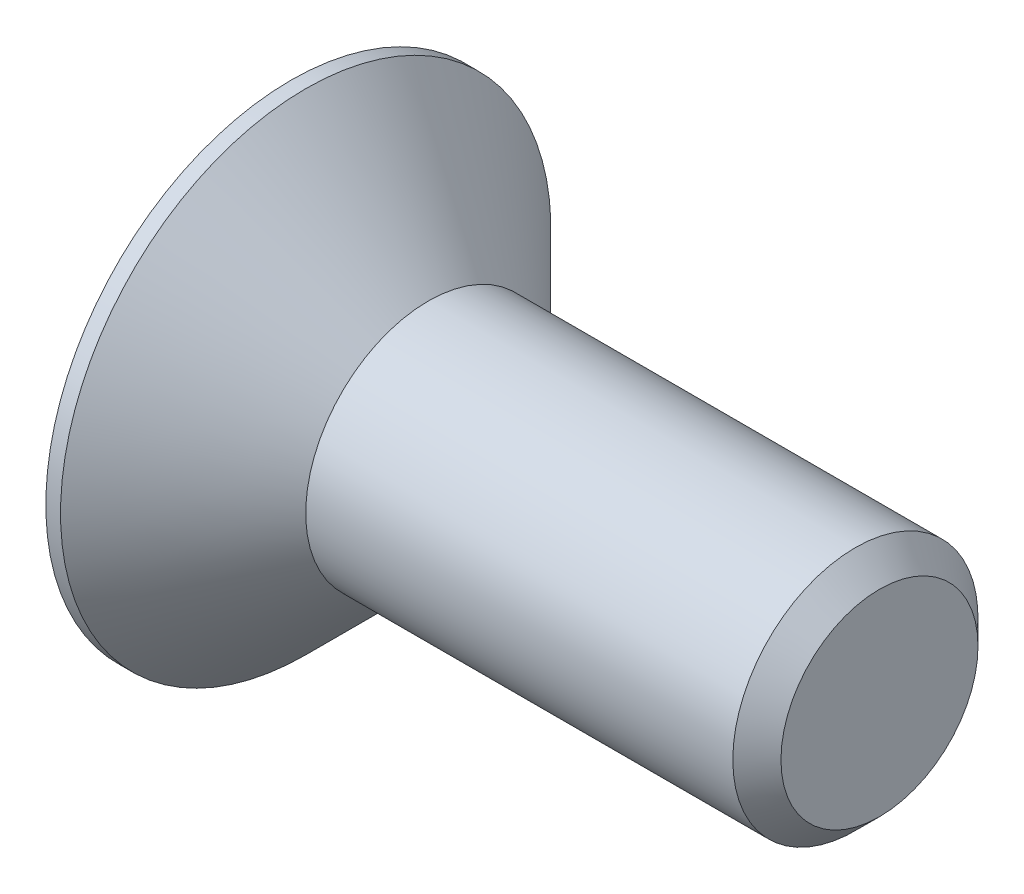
ISO-10303-21;
HEADER;
FILE_DESCRIPTION(('STEP AP214'),'2;1');
FILE_NAME('part.step','',(''),(''),'','','');
FILE_SCHEMA(('AUTOMOTIVE_DESIGN { 1 0 10303 214 1 1 1 1 }'));
ENDSEC;
DATA;
#1=APPLICATION_CONTEXT('core data for automotive mechanical design processes');
#2=APPLICATION_PROTOCOL_DEFINITION('international standard','automotive_design',2000,#1);
#3=PRODUCT_CONTEXT('',#1,'mechanical');
#4=PRODUCT('Part','Part','',(#3));
#5=PRODUCT_RELATED_PRODUCT_CATEGORY('part','',(#4));
#6=PRODUCT_DEFINITION_FORMATION('','',#4);
#7=PRODUCT_DEFINITION_CONTEXT('part definition',#1,'design');
#8=PRODUCT_DEFINITION('design','',#6,#7);
#9=PRODUCT_DEFINITION_SHAPE('','',#8);
#10=(LENGTH_UNIT() NAMED_UNIT(*) SI_UNIT(.MILLI.,.METRE.));
#11=(NAMED_UNIT(*) PLANE_ANGLE_UNIT() SI_UNIT($,.RADIAN.));
#12=(NAMED_UNIT(*) SI_UNIT($,.STERADIAN.) SOLID_ANGLE_UNIT());
#13=UNCERTAINTY_MEASURE_WITH_UNIT(LENGTH_MEASURE(1.E-05),#10,'distance_accuracy_value','');
#14=(GEOMETRIC_REPRESENTATION_CONTEXT(3) GLOBAL_UNCERTAINTY_ASSIGNED_CONTEXT((#13)) GLOBAL_UNIT_ASSIGNED_CONTEXT((#10,
#11,#12)) REPRESENTATION_CONTEXT('',''));
#15=CARTESIAN_POINT('',(0.,0.,0.));
#16=DIRECTION('',(0.,0.,1.));
#17=DIRECTION('',(1.,0.,0.));
#18=AXIS2_PLACEMENT_3D('',#15,#16,#17);
#19=CARTESIAN_POINT('',(12.,1.25,0.));
#20=DIRECTION('',(1.,0.,0.));
#21=DIRECTION('',(0.,1.,0.));
#22=AXIS2_PLACEMENT_3D('',#19,#20,#21);
#23=PLANE('',#22);
#24=CARTESIAN_POINT('',(11.9999999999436,0.,0.));
#25=DIRECTION('',(-1.,0.,0.));
#26=DIRECTION('',(0.,0.,1.));
#27=AXIS2_PLACEMENT_3D('',#24,#25,#26);
#28=CIRCLE('',#27,2.00924000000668);
#29=CARTESIAN_POINT('',(11.9999999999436,0.,2.00924000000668));
#30=VERTEX_POINT('',#29);
#31=EDGE_CURVE('E20',#30,#30,#28,.T.);
#32=ORIENTED_EDGE('',*,*,#31,.F.);
#33=EDGE_LOOP('',(#32));
#34=FACE_BOUND('',#33,.T.);
#35=ADVANCED_FACE('F16',(#34),#23,.T.);
#36=CARTESIAN_POINT('',(11.5092399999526,0.,0.));
#37=DIRECTION('',(-1.,0.,0.));
#38=DIRECTION('',(0.,0.,1.));
#39=AXIS2_PLACEMENT_3D('',#36,#37,#38);
#40=CONICAL_SURFACE('',#39,2.49999999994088,0.785398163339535);
#41=CARTESIAN_POINT('',(11.50924,0.,0.));
#42=DIRECTION('',(1.,0.,0.));
#43=DIRECTION('',(0.,1.,0.));
#44=AXIS2_PLACEMENT_3D('',#41,#42,#43);
#45=CIRCLE('',#44,2.49999999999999);
#46=CARTESIAN_POINT('',(11.50924,2.49999999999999,0.));
#47=VERTEX_POINT('',#46);
#48=EDGE_CURVE('E94',#47,#47,#45,.F.);
#49=ORIENTED_EDGE('',*,*,#48,.F.);
#50=EDGE_LOOP('',(#49));
#51=FACE_BOUND('',#50,.T.);
#52=ORIENTED_EDGE('',*,*,#31,.T.);
#53=EDGE_LOOP('',(#52));
#54=FACE_BOUND('',#53,.T.);
#55=ADVANCED_FACE('F212',(#51,#54),#40,.T.);
#56=CARTESIAN_POINT('',(0.,-1.5,0.866025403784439));
#57=DIRECTION('',(0.,-0.5,0.866025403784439));
#58=DIRECTION('',(0.,-0.866025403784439,-0.5));
#59=AXIS2_PLACEMENT_3D('',#56,#57,#58);
#60=PLANE('',#59);
#61=DIRECTION('',(1.,0.,0.));
#62=VECTOR('',#61,1.);
#63=CARTESIAN_POINT('',(0.,-1.5,0.866025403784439));
#64=LINE('',#63,#62);
#65=CARTESIAN_POINT('',(2.3000000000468,-1.50000000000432,0.866025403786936));
#66=VERTEX_POINT('',#65);
#67=CARTESIAN_POINT('',(0.,-1.5,0.866025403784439));
#68=VERTEX_POINT('',#67);
#69=EDGE_CURVE('E90',#66,#68,#64,.F.);
#70=ORIENTED_EDGE('',*,*,#69,.T.);
#71=DIRECTION('',(0.,-0.866025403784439,-0.5));
#72=VECTOR('',#71,1.);
#73=CARTESIAN_POINT('',(0.,-1.5,0.866025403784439));
#74=LINE('',#73,#72);
#75=CARTESIAN_POINT('',(0.,0.,1.73205080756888));
#76=VERTEX_POINT('',#75);
#77=EDGE_CURVE('E95',#76,#68,#74,.T.);
#78=ORIENTED_EDGE('',*,*,#77,.F.);
#79=DIRECTION('',(1.,0.,0.));
#80=VECTOR('',#79,1.);
#81=CARTESIAN_POINT('',(0.,0.,1.73205080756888));
#82=LINE('',#81,#80);
#83=CARTESIAN_POINT('',(2.30000000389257,-1.15286589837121E-08,1.7320508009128));
#84=VERTEX_POINT('',#83);
#85=EDGE_CURVE('E93',#76,#84,#82,.T.);
#86=ORIENTED_EDGE('',*,*,#85,.T.);
#87=CARTESIAN_POINT('',(2.3000000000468,-1.50000000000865,0.866025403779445));
#88=CARTESIAN_POINT('',(2.32197834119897,-1.43408408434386,0.904081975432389));
#89=CARTESIAN_POINT('',(2.34196649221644,-1.36759918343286,0.942467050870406));
#90=CARTESIAN_POINT('',(2.3768552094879,-1.23347824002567,1.01990181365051));
#91=CARTESIAN_POINT('',(2.39174343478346,-1.16583981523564,1.0589528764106));
#92=CARTESIAN_POINT('',(2.41491803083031,-1.0314011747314,1.13657106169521));
#93=CARTESIAN_POINT('',(2.42335865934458,-0.964621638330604,1.17512624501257));
#94=CARTESIAN_POINT('',(2.43343312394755,-0.830748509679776,1.25241793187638));
#95=CARTESIAN_POINT('',(2.43507530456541,-0.76365540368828,1.29115415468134));
#96=CARTESIAN_POINT('',(2.43165028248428,-0.638299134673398,1.36352863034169));
#97=CARTESIAN_POINT('',(2.42742403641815,-0.580017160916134,1.39717774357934));
#98=CARTESIAN_POINT('',(2.41403202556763,-0.463832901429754,1.4642567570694));
#99=CARTESIAN_POINT('',(2.40486169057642,-0.405931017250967,1.49768642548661));
#100=CARTESIAN_POINT('',(2.38193762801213,-0.289507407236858,1.56490362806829));
#101=CARTESIAN_POINT('',(2.3680867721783,-0.231000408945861,1.59868265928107));
#102=CARTESIAN_POINT('',(2.33665118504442,-0.114858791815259,1.66573705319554));
#103=CARTESIAN_POINT('',(2.31907383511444,-0.0572226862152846,1.69901327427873));
#104=CARTESIAN_POINT('',(2.30000000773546,-2.3057318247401E-08,1.73205079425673));
#105=B_SPLINE_CURVE_WITH_KNOTS('',3,(#87,#88,#89,#90,#91,#92,#93,#94,#95,#96,#97,#98,#99,#100,
#101,#102,#103,#104),.UNSPECIFIED.,.F.,.F.,(4,2,2,2,2,2,2,2,4),(0.,0.237762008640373,
0.476095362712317,0.708530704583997,0.940680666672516,1.14278083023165,1.34506813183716,
1.55184119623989,1.75820845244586),.UNSPECIFIED.);
#106=EDGE_CURVE('E74',#66,#84,#105,.T.);
#107=ORIENTED_EDGE('',*,*,#106,.F.);
#108=EDGE_LOOP('',(#70,#78,#86,#107));
#109=FACE_BOUND('',#108,.T.);
#110=ADVANCED_FACE('F88',(#109),#60,.F.);
#111=CARTESIAN_POINT('',(8.59999999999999,0.,0.));
#112=DIRECTION('',(1.,0.,0.));
#113=DIRECTION('',(0.,1.,0.));
#114=AXIS2_PLACEMENT_3D('',#111,#112,#113);
#115=CYLINDRICAL_SURFACE('',#114,2.49999999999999);
#116=ORIENTED_EDGE('',*,*,#48,.T.);
#117=EDGE_LOOP('',(#116));
#118=FACE_BOUND('',#117,.T.);
#119=CARTESIAN_POINT('',(2.79999999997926,0.,0.));
#120=DIRECTION('',(-1.,0.,0.));
#121=DIRECTION('',(0.,1.,0.));
#122=AXIS2_PLACEMENT_3D('',#119,#120,#121);
#123=CIRCLE('',#122,2.49999999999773);
#124=CARTESIAN_POINT('',(2.79999999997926,2.49999999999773,0.));
#125=VERTEX_POINT('',#124);
#126=EDGE_CURVE('E110',#125,#125,#123,.T.);
#127=ORIENTED_EDGE('',*,*,#126,.F.);
#128=EDGE_LOOP('',(#127));
#129=FACE_BOUND('',#128,.T.);
#130=ADVANCED_FACE('F204',(#118,#129),#115,.T.);
#131=CARTESIAN_POINT('',(0.,-1.5,-0.866025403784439));
#132=DIRECTION('',(0.,-1.,0.));
#133=DIRECTION('',(0.,0.,-1.));
#134=AXIS2_PLACEMENT_3D('',#131,#132,#133);
#135=PLANE('',#134);
#136=DIRECTION('',(1.,0.,0.));
#137=VECTOR('',#136,1.);
#138=CARTESIAN_POINT('',(0.,-1.5,-0.866025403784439));
#139=LINE('',#138,#137);
#140=CARTESIAN_POINT('',(2.29999999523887,-1.5,-0.8660254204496));
#141=VERTEX_POINT('',#140);
#142=CARTESIAN_POINT('',(0.,-1.5,-0.866025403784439));
#143=VERTEX_POINT('',#142);
#144=EDGE_CURVE('E108',#141,#143,#139,.F.);
#145=ORIENTED_EDGE('',*,*,#144,.T.);
#146=DIRECTION('',(0.,0.,-1.));
#147=VECTOR('',#146,1.);
#148=CARTESIAN_POINT('',(0.,-1.5,-0.866025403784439));
#149=LINE('',#148,#147);
#150=EDGE_CURVE('E83',#68,#143,#149,.T.);
#151=ORIENTED_EDGE('',*,*,#150,.F.);
#152=ORIENTED_EDGE('',*,*,#69,.F.);
#153=CARTESIAN_POINT('',(2.29999999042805,-1.5,-0.86602543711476));
#154=CARTESIAN_POINT('',(2.32052466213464,-1.5,-0.794933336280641));
#155=CARTESIAN_POINT('',(2.33931557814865,-1.5,-0.723278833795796));
#156=CARTESIAN_POINT('',(2.37252619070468,-1.5,-0.578805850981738));
#157=CARTESIAN_POINT('',(2.38693610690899,-1.5,-0.505985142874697));
#158=CARTESIAN_POINT('',(2.41010899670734,-1.5,-0.36116084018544));
#159=CARTESIAN_POINT('',(2.41899551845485,-1.5,-0.289177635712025));
#160=CARTESIAN_POINT('',(2.43092514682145,-1.5,-0.144795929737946));
#161=CARTESIAN_POINT('',(2.43397459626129,-1.5,-0.0723979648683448));
#162=CARTESIAN_POINT('',(2.43397459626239,-1.5,0.0723979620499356));
#163=CARTESIAN_POINT('',(2.43092514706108,-1.5,0.144795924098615));
#164=CARTESIAN_POINT('',(2.41899551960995,-1.5,0.289177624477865));
#165=CARTESIAN_POINT('',(2.41010899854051,-1.5,0.36116082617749));
#166=CARTESIAN_POINT('',(2.38693611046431,-1.5,0.505985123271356));
#167=CARTESIAN_POINT('',(2.37252619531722,-1.5,0.578805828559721));
#168=CARTESIAN_POINT('',(2.33931558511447,-1.5,0.72327880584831));
#169=CARTESIAN_POINT('',(2.32052467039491,-1.5,0.794933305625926));
#170=CARTESIAN_POINT('',(2.3000000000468,-1.5,0.866025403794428));
#171=B_SPLINE_CURVE_WITH_KNOTS('',3,(#153,#154,#155,#156,#157,#158,#159,#160,#161,#162,#163,
#164,#165,#166,#167,#168,#169,#170),.UNSPECIFIED.,.F.,.F.,(4,2,2,2,2,2,2,2,4),(0.,
0.22205505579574,0.444602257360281,0.661973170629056,0.879107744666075,1.09624231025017,
1.31361321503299,1.53616040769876,1.75821545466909),.UNSPECIFIED.);
#172=EDGE_CURVE('E69',#141,#66,#171,.T.);
#173=ORIENTED_EDGE('',*,*,#172,.F.);
#174=EDGE_LOOP('',(#145,#151,#152,#173));
#175=FACE_BOUND('',#174,.T.);
#176=ADVANCED_FACE('F96',(#175),#135,.F.);
#177=CARTESIAN_POINT('',(0.,0.,1.73205080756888));
#178=DIRECTION('',(0.,0.500000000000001,0.866025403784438));
#179=DIRECTION('',(0.,-0.866025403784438,0.500000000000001));
#180=AXIS2_PLACEMENT_3D('',#177,#178,#179);
#181=PLANE('',#180);
#182=ORIENTED_EDGE('',*,*,#85,.F.);
#183=DIRECTION('',(0.,-0.866025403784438,0.500000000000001));
#184=VECTOR('',#183,1.);
#185=CARTESIAN_POINT('',(0.,0.,1.73205080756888));
#186=LINE('',#185,#184);
#187=CARTESIAN_POINT('',(0.,1.5,0.866025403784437));
#188=VERTEX_POINT('',#187);
#189=EDGE_CURVE('E82',#188,#76,#186,.T.);
#190=ORIENTED_EDGE('',*,*,#189,.F.);
#191=DIRECTION('',(1.,0.,0.));
#192=VECTOR('',#191,1.);
#193=CARTESIAN_POINT('',(0.,1.5,0.866025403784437));
#194=LINE('',#193,#192);
#195=CARTESIAN_POINT('',(2.3000000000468,1.50000000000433,0.866025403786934));
#196=VERTEX_POINT('',#195);
#197=EDGE_CURVE('E113',#188,#196,#194,.T.);
#198=ORIENTED_EDGE('',*,*,#197,.T.);
#199=CARTESIAN_POINT('',(2.30000000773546,2.30573176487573E-08,1.73205079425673));
#200=CARTESIAN_POINT('',(2.32197834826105,0.0659159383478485,1.69399422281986));
#201=CARTESIAN_POINT('',(2.34196649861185,0.132400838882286,1.65560914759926));
#202=CARTESIAN_POINT('',(2.37685521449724,0.266521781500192,1.57817438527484));
#203=CARTESIAN_POINT('',(2.39174343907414,0.33416020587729,1.53912332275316));
#204=CARTESIAN_POINT('',(2.41491803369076,0.468598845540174,1.46150513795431));
#205=CARTESIAN_POINT('',(2.42335866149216,0.535378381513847,1.42294995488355));
#206=CARTESIAN_POINT('',(2.43343312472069,0.669251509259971,1.34565826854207));
#207=CARTESIAN_POINT('',(2.43507530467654,0.73634461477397,1.30692204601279));
#208=CARTESIAN_POINT('',(2.43165028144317,0.861700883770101,1.23454757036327));
#209=CARTESIAN_POINT('',(2.42742403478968,0.919982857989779,1.20089845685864));
#210=CARTESIAN_POINT('',(2.41403202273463,1.03616711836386,1.13381944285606));
#211=CARTESIAN_POINT('',(2.40486168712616,1.09406900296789,1.10038977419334));
#212=CARTESIAN_POINT('',(2.38193762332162,1.21049261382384,1.03317257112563));
#213=CARTESIAN_POINT('',(2.36808676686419,1.26899961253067,0.999393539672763));
#214=CARTESIAN_POINT('',(2.33665117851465,1.38514123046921,0.932339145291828));
#215=CARTESIAN_POINT('',(2.31907382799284,1.44277733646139,0.8990629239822));
#216=CARTESIAN_POINT('',(2.3000000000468,1.50000000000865,0.866025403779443));
#217=B_SPLINE_CURVE_WITH_KNOTS('',3,(#199,#200,#201,#202,#203,#204,#205,#206,#207,#208,#209,
#210,#211,#212,#213,#214,#215,#216),.UNSPECIFIED.,.F.,.F.,(4,2,2,2,2,2,2,2,4),(0.,
0.237762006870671,0.476095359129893,0.708530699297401,0.940680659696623,1.14278082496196,
1.34506812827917,1.55184119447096,1.75820845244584),.UNSPECIFIED.);
#218=EDGE_CURVE('E105',#84,#196,#217,.T.);
#219=ORIENTED_EDGE('',*,*,#218,.F.);
#220=EDGE_LOOP('',(#182,#190,#198,#219));
#221=FACE_BOUND('',#220,.T.);
#222=ADVANCED_FACE('F195',(#221),#181,.F.);
#223=CARTESIAN_POINT('',(0.300000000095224,0.,0.));
#224=DIRECTION('',(-1.,0.,0.));
#225=DIRECTION('',(0.,0.,1.));
#226=AXIS2_PLACEMENT_3D('',#223,#224,#225);
#227=CONICAL_SURFACE('',#226,4.99999999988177,0.785398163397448);
#228=ORIENTED_EDGE('',*,*,#126,.T.);
#229=EDGE_LOOP('',(#228));
#230=FACE_BOUND('',#229,.T.);
#231=CARTESIAN_POINT('',(0.29999999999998,0.,0.));
#232=DIRECTION('',(1.,0.,0.));
#233=DIRECTION('',(0.,1.,0.));
#234=AXIS2_PLACEMENT_3D('',#231,#232,#233);
#235=CIRCLE('',#234,5.00000000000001);
#236=CARTESIAN_POINT('',(0.29999999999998,5.00000000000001,0.));
#237=VERTEX_POINT('',#236);
#238=EDGE_CURVE('E127',#237,#237,#235,.F.);
#239=ORIENTED_EDGE('',*,*,#238,.F.);
#240=EDGE_LOOP('',(#239));
#241=FACE_BOUND('',#240,.T.);
#242=ADVANCED_FACE('F191',(#230,#241),#227,.T.);
#243=CARTESIAN_POINT('',(0.,0.,-1.73205080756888));
#244=DIRECTION('',(0.,-0.5,-0.866025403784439));
#245=DIRECTION('',(0.,0.866025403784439,-0.5));
#246=AXIS2_PLACEMENT_3D('',#243,#244,#245);
#247=PLANE('',#246);
#248=DIRECTION('',(1.,0.,0.));
#249=VECTOR('',#248,1.);
#250=CARTESIAN_POINT('',(0.,0.,-1.73205080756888));
#251=LINE('',#250,#249);
#252=CARTESIAN_POINT('',(2.3000000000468,0.,-1.73205080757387));
#253=VERTEX_POINT('',#252);
#254=CARTESIAN_POINT('',(0.,0.,-1.73205080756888));
#255=VERTEX_POINT('',#254);
#256=EDGE_CURVE('E123',#253,#255,#251,.F.);
#257=ORIENTED_EDGE('',*,*,#256,.T.);
#258=DIRECTION('',(0.,0.866025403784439,-0.5));
#259=VECTOR('',#258,1.);
#260=CARTESIAN_POINT('',(0.,0.,-1.73205080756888));
#261=LINE('',#260,#259);
#262=EDGE_CURVE('E34',#143,#255,#261,.T.);
#263=ORIENTED_EDGE('',*,*,#262,.F.);
#264=ORIENTED_EDGE('',*,*,#144,.F.);
#265=CARTESIAN_POINT('',(2.3000000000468,8.65064451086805E-12,-1.73205080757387));
#266=CARTESIAN_POINT('',(2.32197834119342,-0.0659159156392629,-1.69399423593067));
#267=CARTESIAN_POINT('',(2.34196649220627,-0.132400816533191,-1.65560916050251));
#268=CARTESIAN_POINT('',(2.37685520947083,-0.266521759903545,-1.57817439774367));
#269=CARTESIAN_POINT('',(2.39174343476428,-0.334160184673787,-1.53912333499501));
#270=CARTESIAN_POINT('',(2.41491803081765,-0.468598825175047,-1.46150514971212));
#271=CARTESIAN_POINT('',(2.42335865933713,-0.535378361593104,-1.4229499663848));
#272=CARTESIAN_POINT('',(2.43343312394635,-0.669251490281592,-1.34565827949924));
#273=CARTESIAN_POINT('',(2.43507530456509,-0.736344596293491,-1.3069220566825));
#274=CARTESIAN_POINT('',(2.4316502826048,-0.861700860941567,-1.23454758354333));
#275=CARTESIAN_POINT('',(2.42742403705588,-0.919982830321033,-1.2008984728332));
#276=CARTESIAN_POINT('',(2.41403202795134,-1.03616708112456,-1.13381946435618));
#277=CARTESIAN_POINT('',(2.40486169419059,-1.09406896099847,-1.1003897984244));
#278=CARTESIAN_POINT('',(2.38193763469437,-1.21049256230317,-1.03317260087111));
#279=CARTESIAN_POINT('',(2.36808678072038,-1.26899955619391,-0.999393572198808));
#280=CARTESIAN_POINT('',(2.33665119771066,-1.38514116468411,-0.932339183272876));
#281=CARTESIAN_POINT('',(2.31907385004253,-1.44277726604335,-0.899062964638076));
#282=CARTESIAN_POINT('',(2.300000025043,-1.49999992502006,-0.86602544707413));
#283=B_SPLINE_CURVE_WITH_KNOTS('',3,(#265,#266,#267,#268,#269,#270,#271,#272,#273,#274,#275,
#276,#277,#278,#279,#280,#281,#282),.UNSPECIFIED.,.F.,.F.,(4,2,2,2,2,2,2,2,4),(0.,
0.237762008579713,0.476095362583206,0.708530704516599,0.940680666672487,1.14278081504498,
1.34506810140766,1.551841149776,1.75820839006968),.UNSPECIFIED.);
#284=EDGE_CURVE('E77',#253,#141,#283,.T.);
#285=ORIENTED_EDGE('',*,*,#284,.F.);
#286=EDGE_LOOP('',(#257,#263,#264,#285));
#287=FACE_BOUND('',#286,.T.);
#288=ADVANCED_FACE('F187',(#287),#247,.F.);
#289=CARTESIAN_POINT('',(0.,1.5,0.866025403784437));
#290=DIRECTION('',(0.,1.,0.));
#291=DIRECTION('',(0.,0.,1.));
#292=AXIS2_PLACEMENT_3D('',#289,#290,#291);
#293=PLANE('',#292);
#294=ORIENTED_EDGE('',*,*,#197,.F.);
#295=DIRECTION('',(0.,0.,1.));
#296=VECTOR('',#295,1.);
#297=CARTESIAN_POINT('',(0.,1.5,0.866025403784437));
#298=LINE('',#297,#296);
#299=CARTESIAN_POINT('',(0.,1.5,-0.866025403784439));
#300=VERTEX_POINT('',#299);
#301=EDGE_CURVE('E117',#300,#188,#298,.T.);
#302=ORIENTED_EDGE('',*,*,#301,.F.);
#303=DIRECTION('',(1.,0.,0.));
#304=VECTOR('',#303,1.);
#305=CARTESIAN_POINT('',(0.,1.5,-0.866025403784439));
#306=LINE('',#305,#304);
#307=CARTESIAN_POINT('',(2.30000001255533,1.5,-0.866025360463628));
#308=VERTEX_POINT('',#307);
#309=EDGE_CURVE('E120',#300,#308,#306,.T.);
#310=ORIENTED_EDGE('',*,*,#309,.T.);
#311=CARTESIAN_POINT('',(2.3000000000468,1.5,0.866025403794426));
#312=CARTESIAN_POINT('',(2.32052467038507,1.5,0.794933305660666));
#313=CARTESIAN_POINT('',(2.33931558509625,1.5,0.723278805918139));
#314=CARTESIAN_POINT('',(2.37252619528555,1.5,0.578805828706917));
#315=CARTESIAN_POINT('',(2.38693611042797,1.5,0.505985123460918));
#316=CARTESIAN_POINT('',(2.41010899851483,1.5,0.361160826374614));
#317=CARTESIAN_POINT('',(2.41899551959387,1.5,0.289177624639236));
#318=CARTESIAN_POINT('',(2.43092514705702,1.5,0.144795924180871));
#319=CARTESIAN_POINT('',(2.43397459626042,1.5,0.0723979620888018));
#320=CARTESIAN_POINT('',(2.43397459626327,1.5,-0.0723979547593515));
#321=CARTESIAN_POINT('',(2.43092514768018,1.5,-0.144795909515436));
#322=CARTESIAN_POINT('',(2.41899552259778,1.5,-0.289177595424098));
#323=CARTESIAN_POINT('',(2.41010900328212,1.5,-0.361160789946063));
#324=CARTESIAN_POINT('',(2.38693611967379,1.5,-0.505985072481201));
#325=CARTESIAN_POINT('',(2.37252620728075,1.5,-0.578805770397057));
#326=CARTESIAN_POINT('',(2.3393156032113,1.5,-0.723278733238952));
#327=CARTESIAN_POINT('',(2.32052469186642,1.5,-0.794933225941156));
#328=CARTESIAN_POINT('',(2.30000002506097,1.5,-0.866025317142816));
#329=B_SPLINE_CURVE_WITH_KNOTS('',3,(#311,#312,#313,#314,#315,#316,#317,#318,#319,#320,#321,
#322,#323,#324,#325,#326,#327,#328),.UNSPECIFIED.,.F.,.F.,(4,2,2,2,2,2,2,2,4),(0.,
0.222055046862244,0.444602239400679,0.661973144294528,0.879107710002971,1.09624225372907,
1.31361313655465,1.53616030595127,1.7582153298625),.UNSPECIFIED.);
#330=EDGE_CURVE('E116',#196,#308,#329,.T.);
#331=ORIENTED_EDGE('',*,*,#330,.F.);
#332=EDGE_LOOP('',(#294,#302,#310,#331));
#333=FACE_BOUND('',#332,.T.);
#334=ADVANCED_FACE('F175',(#333),#293,.F.);
#335=CARTESIAN_POINT('',(3.30000000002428,0.,0.));
#336=DIRECTION('',(-1.,0.,0.));
#337=DIRECTION('',(0.,0.,1.));
#338=AXIS2_PLACEMENT_3D('',#335,#336,#337);
#339=CONICAL_SURFACE('',#338,0.,1.0471975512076);
#340=ORIENTED_EDGE('',*,*,#172,.T.);
#341=ORIENTED_EDGE('',*,*,#106,.T.);
#342=ORIENTED_EDGE('',*,*,#218,.T.);
#343=ORIENTED_EDGE('',*,*,#330,.T.);
#344=CARTESIAN_POINT('',(2.29999999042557,1.50000002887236,-0.866025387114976));
#345=CARTESIAN_POINT('',(2.32197833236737,1.43408411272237,-0.904081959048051));
#346=CARTESIAN_POINT('',(2.3419664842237,1.36759921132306,-0.942467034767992));
#347=CARTESIAN_POINT('',(2.37685520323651,1.23347826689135,-1.0199017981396));
#348=CARTESIAN_POINT('',(2.39174342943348,1.16583984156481,-1.05895286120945));
#349=CARTESIAN_POINT('',(2.41491802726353,1.03140120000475,-1.13657104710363));
#350=CARTESIAN_POINT('',(2.42335865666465,0.96462166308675,-1.1751262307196));
#351=CARTESIAN_POINT('',(2.43343312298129,0.830748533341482,-1.25241791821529));
#352=CARTESIAN_POINT('',(2.43507530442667,0.763655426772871,-1.29115414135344));
#353=CARTESIAN_POINT('',(2.43165028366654,0.638299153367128,-1.36352861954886));
#354=CARTESIAN_POINT('',(2.42742403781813,0.580017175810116,-1.3971777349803));
#355=CARTESIAN_POINT('',(2.41403202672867,0.463832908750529,-1.46425675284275));
#356=CARTESIAN_POINT('',(2.40486169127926,0.405931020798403,-1.4976864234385));
#357=CARTESIAN_POINT('',(2.38193762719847,0.289507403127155,-1.56490363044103));
#358=CARTESIAN_POINT('',(2.3680867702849,0.231000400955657,-1.59868266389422));
#359=CARTESIAN_POINT('',(2.33665118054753,0.114858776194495,-1.66573706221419));
#360=CARTESIAN_POINT('',(2.31907382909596,0.0572226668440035,-1.69901328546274));
#361=CARTESIAN_POINT('',(2.3000000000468,-8.65052799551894E-12,-1.73205080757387));
#362=B_SPLINE_CURVE_WITH_KNOTS('',3,(#344,#345,#346,#347,#348,#349,#350,#351,#352,#353,#354,
#355,#356,#357,#358,#359,#360,#361),.UNSPECIFIED.,.F.,.F.,(4,2,2,2,2,2,2,2,4),(0.,
0.237762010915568,0.476095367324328,0.708530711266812,0.940680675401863,1.14278085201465,
1.34506816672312,1.55184124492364,1.75820851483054),.UNSPECIFIED.);
#363=EDGE_CURVE('E122',#308,#253,#362,.T.);
#364=ORIENTED_EDGE('',*,*,#363,.T.);
#365=ORIENTED_EDGE('',*,*,#284,.T.);
#366=EDGE_LOOP('',(#340,#341,#342,#343,#364,#365));
#367=FACE_BOUND('',#366,.T.);
#368=CARTESIAN_POINT('',(3.30000000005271,2.8421709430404E-11,0.));
#369=VERTEX_POINT('',#368);
#370=VERTEX_LOOP('',#369);
#371=FACE_BOUND('',#370,.T.);
#372=ADVANCED_FACE('F71',(#367,#371),#339,.F.);
#373=CARTESIAN_POINT('',(0.14999999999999,0.,0.));
#374=DIRECTION('',(1.,0.,0.));
#375=DIRECTION('',(0.,1.,0.));
#376=AXIS2_PLACEMENT_3D('',#373,#374,#375);
#377=CYLINDRICAL_SURFACE('',#376,5.00000000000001);
#378=ORIENTED_EDGE('',*,*,#238,.T.);
#379=EDGE_LOOP('',(#378));
#380=FACE_BOUND('',#379,.T.);
#381=CARTESIAN_POINT('',(0.,0.,0.));
#382=DIRECTION('',(1.,0.,0.));
#383=DIRECTION('',(0.,1.,0.));
#384=AXIS2_PLACEMENT_3D('',#381,#382,#383);
#385=CIRCLE('',#384,5.00000000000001);
#386=CARTESIAN_POINT('',(0.,5.00000000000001,0.));
#387=VERTEX_POINT('',#386);
#388=EDGE_CURVE('E26',#387,#387,#385,.F.);
#389=ORIENTED_EDGE('',*,*,#388,.F.);
#390=EDGE_LOOP('',(#389));
#391=FACE_BOUND('',#390,.T.);
#392=ADVANCED_FACE('F168',(#380,#391),#377,.T.);
#393=CARTESIAN_POINT('',(0.,1.5,-0.866025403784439));
#394=DIRECTION('',(0.,0.5,-0.866025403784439));
#395=DIRECTION('',(0.,0.866025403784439,0.5));
#396=AXIS2_PLACEMENT_3D('',#393,#394,#395);
#397=PLANE('',#396);
#398=ORIENTED_EDGE('',*,*,#309,.F.);
#399=DIRECTION('',(0.,0.866025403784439,0.5));
#400=VECTOR('',#399,1.);
#401=CARTESIAN_POINT('',(0.,0.,-1.73205080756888));
#402=LINE('',#401,#400);
#403=EDGE_CURVE('E10',#255,#300,#402,.T.);
#404=ORIENTED_EDGE('',*,*,#403,.F.);
#405=ORIENTED_EDGE('',*,*,#256,.F.);
#406=ORIENTED_EDGE('',*,*,#363,.F.);
#407=EDGE_LOOP('',(#398,#404,#405,#406));
#408=FACE_BOUND('',#407,.T.);
#409=ADVANCED_FACE('F165',(#408),#397,.F.);
#410=CARTESIAN_POINT('',(0.,3.36602540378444,0.));
#411=DIRECTION('',(-1.,0.,0.));
#412=DIRECTION('',(0.,-1.,0.));
#413=AXIS2_PLACEMENT_3D('',#410,#411,#412);
#414=PLANE('',#413);
#415=ORIENTED_EDGE('',*,*,#262,.T.);
#416=ORIENTED_EDGE('',*,*,#403,.T.);
#417=ORIENTED_EDGE('',*,*,#301,.T.);
#418=ORIENTED_EDGE('',*,*,#189,.T.);
#419=ORIENTED_EDGE('',*,*,#77,.T.);
#420=ORIENTED_EDGE('',*,*,#150,.T.);
#421=EDGE_LOOP('',(#415,#416,#417,#418,#419,#420));
#422=FACE_BOUND('',#421,.T.);
#423=ORIENTED_EDGE('',*,*,#388,.T.);
#424=EDGE_LOOP('',(#423));
#425=FACE_BOUND('',#424,.T.);
#426=ADVANCED_FACE('F18',(#422,#425),#414,.T.);
#427=CLOSED_SHELL('',(#35,#55,#110,#130,#176,#222,#242,#288,#334,#372,#392,#409,#426));
#428=MANIFOLD_SOLID_BREP('B1',#427);
#429=ADVANCED_BREP_SHAPE_REPRESENTATION('',(#18,#428),#14);
#430=SHAPE_DEFINITION_REPRESENTATION(#9,#429);
ENDSEC;
END-ISO-10303-21;
